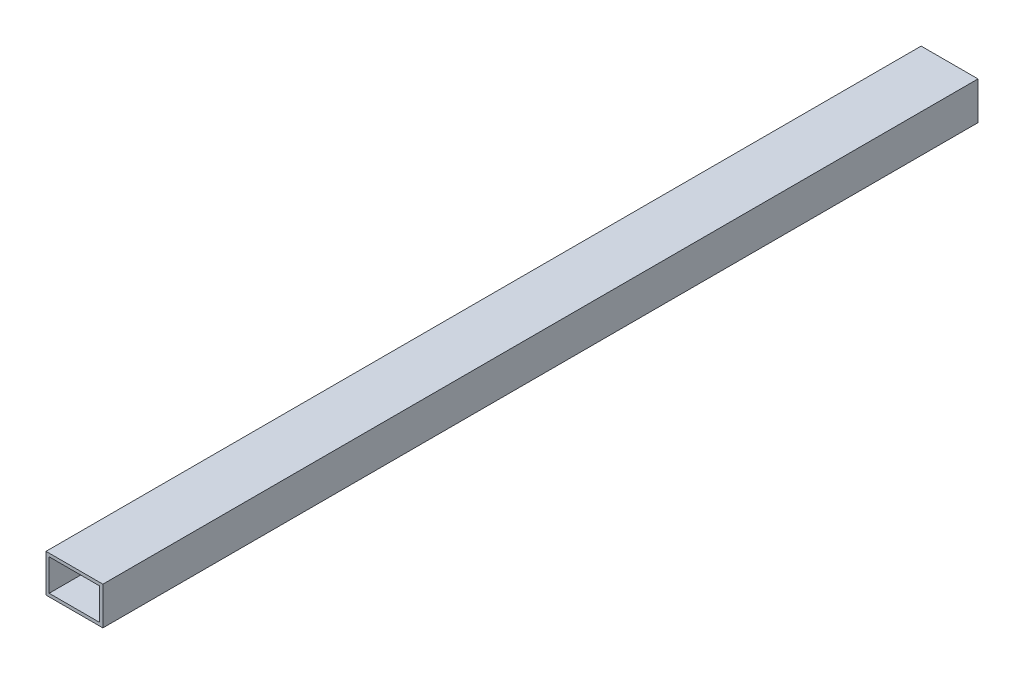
from build123d import *

# Parameters (mm, degrees)
SKETCH1_W           = 114.3
SKETCH1_H           = 76.2
SKETCH1_W_2         = 101.6
SKETCH1_H_2         = 63.5
BOSS_EXTRUDE1_DEPTH = 1758.95


with BuildPart() as part:
    # Sketch1 → Boss-Extrude1 (new body)
    with BuildSketch(Plane.XY):
        with Locations((-184.15, -44.45)):
            Rectangle(SKETCH1_W, SKETCH1_H)
        with Locations((-184.15, -44.45)):
            Rectangle(SKETCH1_W_2, SKETCH1_H_2, mode=Mode.SUBTRACT)
    extrude(amount=BOSS_EXTRUDE1_DEPTH)


solid = part.part
